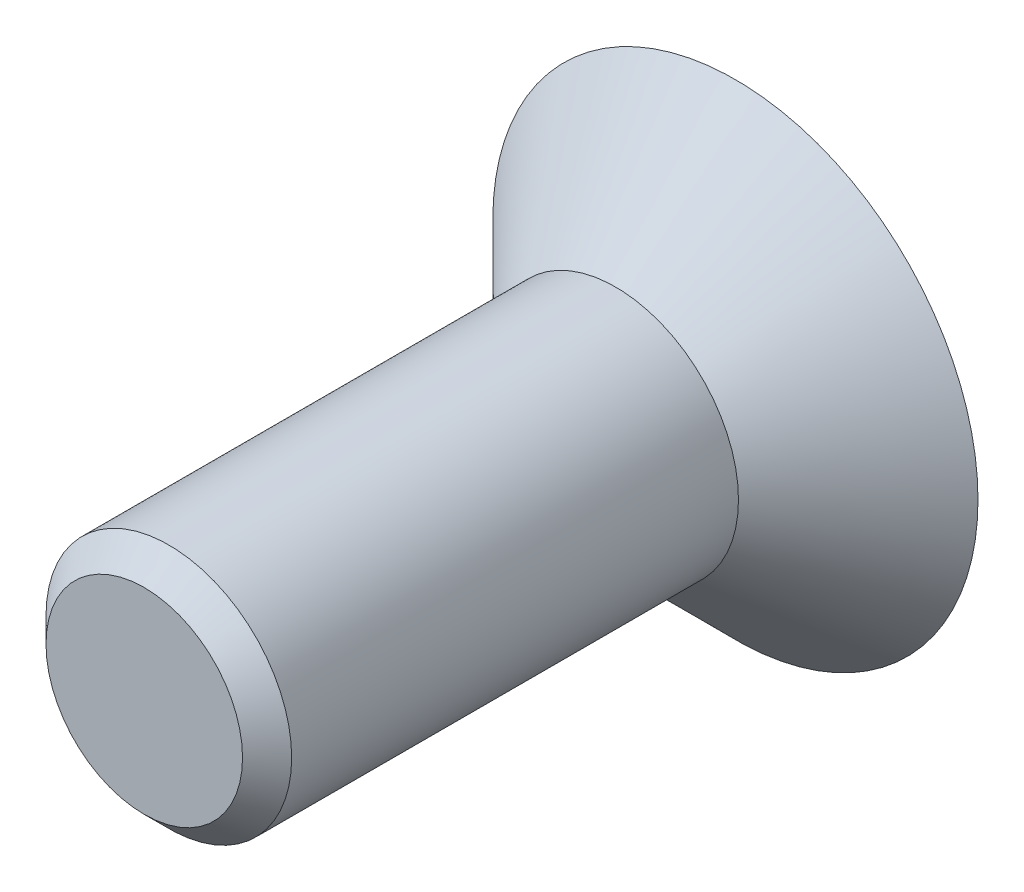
from build123d import *

# Parameters (mm, degrees)
FENTE1_DEPTH    = 3.8
ESQUISSE3_W     = 4
ESQUISSE3_H     = 15.35
CHANFREIN1_SIZE = 0.8


with BuildPart() as part:
    # Esquisse1 → Base-R_volution (revolve)
    with BuildSketch(Plane(origin=(0, 0, 0), x_dir=(1, 0, 0), z_dir=(0, 1, 0))):
        Polygon((4, 0), (7.9, 3.9), (0, 3.9), (0, 0), align=None)
    revolve(axis=Axis((0, 0, 0), (0, 0, -1)))

    # Esquisse2 → fente1 (cut)
    with BuildSketch(Plane.XY.offset(-3.9)):
        Polygon((2.5, -1.443375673), (2.5, 1.443375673), (0, 2.886751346), (-2.5, 1.443375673), (-2.5, -1.443375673), (0, -2.886751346), align=None)
    extrude(amount=FENTE1_DEPTH, mode=Mode.SUBTRACT)

    # Esquisse3 → Boss.-R_vol.1 (revolve)
    with BuildSketch(Plane(origin=(0, 0, 0), x_dir=(1, 0, 0), z_dir=(0, 1, 0))):
        with Locations((2, -7.675)):
            Rectangle(ESQUISSE3_W, ESQUISSE3_H)
    revolve(axis=Axis((0, 0, 0), (0, 0, 1)))

    # Chanfrein1
    chanfrein1_edges = [part.edges().sort_by_distance(p)[0] for p in [
        (-4, 0, 15.35),
    ]]
    chamfer(chanfrein1_edges, length=CHANFREIN1_SIZE)


solid = part.part
